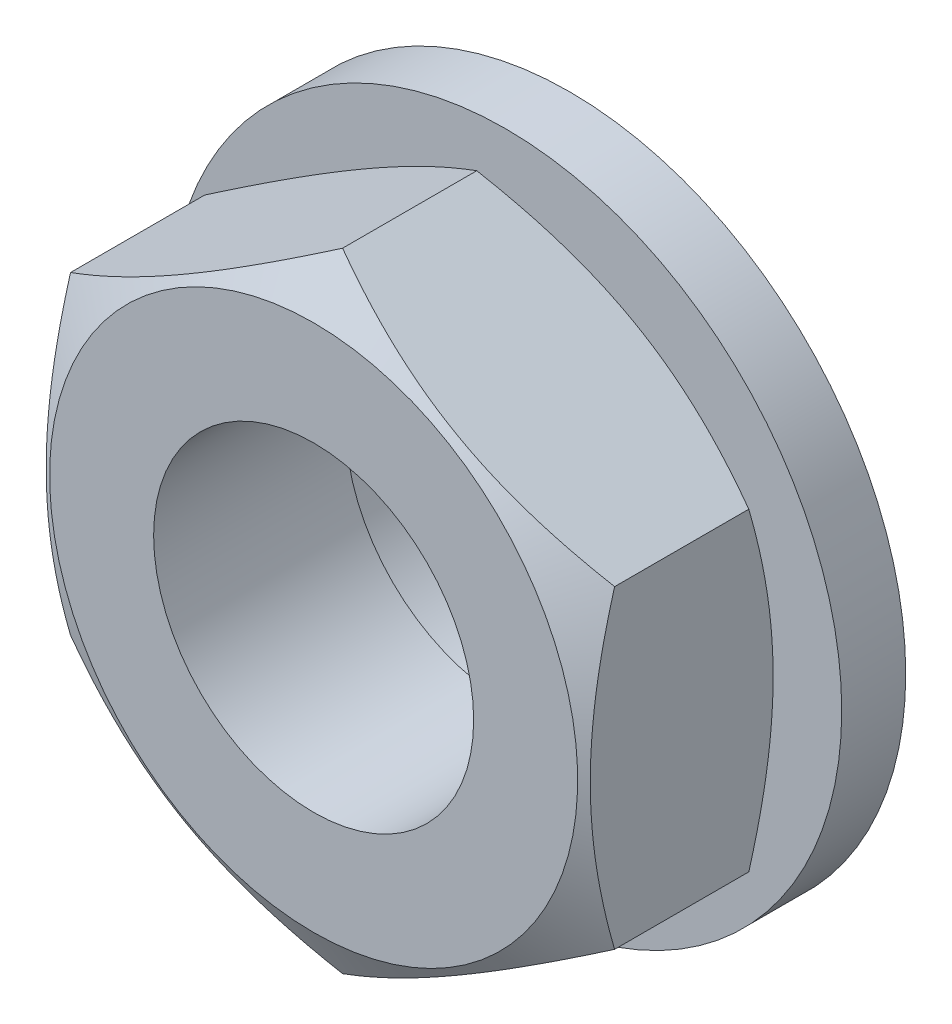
ISO-10303-21;
HEADER;
FILE_DESCRIPTION(('STEP AP214'),'2;1');
FILE_NAME('part.step','',(''),(''),'','','');
FILE_SCHEMA(('AUTOMOTIVE_DESIGN { 1 0 10303 214 1 1 1 1 }'));
ENDSEC;
DATA;
#1=APPLICATION_CONTEXT('core data for automotive mechanical design processes');
#2=APPLICATION_PROTOCOL_DEFINITION('international standard','automotive_design',2000,#1);
#3=PRODUCT_CONTEXT('',#1,'mechanical');
#4=PRODUCT('Part','Part','',(#3));
#5=PRODUCT_RELATED_PRODUCT_CATEGORY('part','',(#4));
#6=PRODUCT_DEFINITION_FORMATION('','',#4);
#7=PRODUCT_DEFINITION_CONTEXT('part definition',#1,'design');
#8=PRODUCT_DEFINITION('design','',#6,#7);
#9=PRODUCT_DEFINITION_SHAPE('','',#8);
#10=(LENGTH_UNIT() NAMED_UNIT(*) SI_UNIT(.MILLI.,.METRE.));
#11=(NAMED_UNIT(*) PLANE_ANGLE_UNIT() SI_UNIT($,.RADIAN.));
#12=(NAMED_UNIT(*) SI_UNIT($,.STERADIAN.) SOLID_ANGLE_UNIT());
#13=UNCERTAINTY_MEASURE_WITH_UNIT(LENGTH_MEASURE(1.E-05),#10,'distance_accuracy_value','');
#14=(GEOMETRIC_REPRESENTATION_CONTEXT(3) GLOBAL_UNCERTAINTY_ASSIGNED_CONTEXT((#13)) GLOBAL_UNIT_ASSIGNED_CONTEXT((#10,
#11,#12)) REPRESENTATION_CONTEXT('',''));
#15=CARTESIAN_POINT('',(0.,0.,0.));
#16=DIRECTION('',(0.,0.,1.));
#17=DIRECTION('',(1.,0.,0.));
#18=AXIS2_PLACEMENT_3D('',#15,#16,#17);
#19=CARTESIAN_POINT('',(-8.5,-4.90747728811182,10.));
#20=DIRECTION('',(-1.,0.,0.));
#21=DIRECTION('',(0.,0.,1.));
#22=AXIS2_PLACEMENT_3D('',#19,#20,#21);
#23=PLANE('',#22);
#24=CARTESIAN_POINT('',(-8.5,-13.2220103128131,3.68805373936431));
#25=CARTESIAN_POINT('',(-8.5,-12.8504235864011,3.86846678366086));
#26=CARTESIAN_POINT('',(-8.5,-12.4779881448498,4.04716148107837));
#27=CARTESIAN_POINT('',(-8.5,-11.7309686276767,4.40014855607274));
#28=CARTESIAN_POINT('',(-8.5,-11.356384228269,4.57444024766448));
#29=CARTESIAN_POINT('',(-8.5,-10.602704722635,4.91852400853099));
#30=CARTESIAN_POINT('',(-8.5,-10.2235961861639,5.08828676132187));
#31=CARTESIAN_POINT('',(-8.5,-9.46237784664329,5.42091824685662));
#32=CARTESIAN_POINT('',(-8.5,-9.08026818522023,5.5837873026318));
#33=CARTESIAN_POINT('',(-8.5,-8.29995060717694,5.90596922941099));
#34=CARTESIAN_POINT('',(-8.5,-7.90162321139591,6.06499431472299));
#35=CARTESIAN_POINT('',(-8.5,-7.10032398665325,6.37110535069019));
#36=CARTESIAN_POINT('',(-8.5,-6.69735164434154,6.51818996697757));
#37=CARTESIAN_POINT('',(-8.5,-5.88685796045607,6.79658764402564));
#38=CARTESIAN_POINT('',(-8.5,-5.47934758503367,6.927932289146));
#39=CARTESIAN_POINT('',(-8.5,-4.65849578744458,7.17066339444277));
#40=CARTESIAN_POINT('',(-8.5,-4.24515623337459,7.28205609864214));
#41=CARTESIAN_POINT('',(-8.5,-3.4146465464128,7.47896177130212));
#42=CARTESIAN_POINT('',(-8.5,-2.99751098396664,7.56461662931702));
#43=CARTESIAN_POINT('',(-8.5,-2.36797724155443,7.67010811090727));
#44=CARTESIAN_POINT('',(-8.5,-2.15747910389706,7.70144155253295));
#45=CARTESIAN_POINT('',(-8.5,-1.7354230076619,7.75583120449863));
#46=CARTESIAN_POINT('',(-8.5,-1.52386515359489,7.77888821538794));
#47=CARTESIAN_POINT('',(-8.5,-1.10275446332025,7.81597435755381));
#48=CARTESIAN_POINT('',(-8.5,-0.893211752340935,7.83011800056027));
#49=CARTESIAN_POINT('',(-8.5,-0.473715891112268,7.84952934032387));
#50=CARTESIAN_POINT('',(-8.5,-0.263762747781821,7.85479718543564));
#51=CARTESIAN_POINT('',(-8.5,0.156178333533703,7.85633113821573));
#52=CARTESIAN_POINT('',(-8.5,0.366166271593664,7.85259722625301));
#53=CARTESIAN_POINT('',(-8.5,0.785797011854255,7.83621947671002));
#54=CARTESIAN_POINT('',(-8.5,0.995439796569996,7.82357520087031));
#55=CARTESIAN_POINT('',(-8.5,1.49806512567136,7.78284710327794));
#56=CARTESIAN_POINT('',(-8.5,1.79071777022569,7.75060284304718));
#57=CARTESIAN_POINT('',(-8.5,2.37386344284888,7.6705007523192));
#58=CARTESIAN_POINT('',(-8.5,2.66435617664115,7.62264083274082));
#59=CARTESIAN_POINT('',(-8.5,3.53225535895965,7.45817427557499));
#60=CARTESIAN_POINT('',(-8.5,4.10576233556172,7.32071025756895));
#61=CARTESIAN_POINT('',(-8.5,4.96336295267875,7.08216925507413));
#62=CARTESIAN_POINT('',(-8.5,5.25190046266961,6.9961484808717));
#63=CARTESIAN_POINT('',(-8.5,5.82617341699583,6.81513030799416));
#64=CARTESIAN_POINT('',(-8.5,6.11190884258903,6.72013284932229));
#65=CARTESIAN_POINT('',(-8.5,6.68066668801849,6.52268903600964));
#66=CARTESIAN_POINT('',(-8.5,6.96368995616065,6.42024510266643));
#67=CARTESIAN_POINT('',(-8.5,7.52738867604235,6.2091179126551));
#68=CARTESIAN_POINT('',(-8.5,7.80806415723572,6.10043473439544));
#69=CARTESIAN_POINT('',(-8.5,8.47808910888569,5.83378477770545));
#70=CARTESIAN_POINT('',(-8.5,8.86645338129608,5.67334679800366));
#71=CARTESIAN_POINT('',(-8.5,9.6398127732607,5.34452258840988));
#72=CARTESIAN_POINT('',(-8.5,10.0248076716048,5.17613584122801));
#73=CARTESIAN_POINT('',(-8.5,10.7920682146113,4.83303130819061));
#74=CARTESIAN_POINT('',(-8.5,11.174333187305,4.65831202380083));
#75=CARTESIAN_POINT('',(-8.5,11.9365059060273,4.30384068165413));
#76=CARTESIAN_POINT('',(-8.5,12.3164137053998,4.12408873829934));
#77=CARTESIAN_POINT('',(-8.5,13.0747039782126,3.76030061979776));
#78=CARTESIAN_POINT('',(-8.5,13.4530842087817,3.57625977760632));
#79=CARTESIAN_POINT('',(-8.5,14.2081968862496,3.20482942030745));
#80=CARTESIAN_POINT('',(-8.5,14.5849293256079,3.01743988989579));
#81=CARTESIAN_POINT('',(-8.5,15.7129519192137,2.45120240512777));
#82=CARTESIAN_POINT('',(-8.5,16.4621734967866,2.06823420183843));
#83=CARTESIAN_POINT('',(-8.5,17.8924783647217,1.32781566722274));
#84=CARTESIAN_POINT('',(-8.5,18.5738900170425,0.970996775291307));
#85=CARTESIAN_POINT('',(-8.5,19.9341904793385,0.252523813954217));
#86=CARTESIAN_POINT('',(-8.5,20.6130791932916,-0.109130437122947));
#87=CARTESIAN_POINT('',(-8.5,21.9671358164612,-0.835169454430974));
#88=CARTESIAN_POINT('',(-8.5,22.6423088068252,-1.19954475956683));
#89=CARTESIAN_POINT('',(-8.5,23.9910464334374,-1.93116924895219));
#90=CARTESIAN_POINT('',(-8.5,24.6646111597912,-2.29841826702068));
#91=CARTESIAN_POINT('',(-8.5,25.3375864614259,-2.66673700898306));
#92=B_SPLINE_CURVE_WITH_KNOTS('',3,(#24,#25,#26,#27,#28,#29,#30,#31,#32,#33,#34,#35,#36,#37,#38,
#39,#40,#41,#42,#43,#44,#45,#46,#47,#48,#49,#50,#51,#52,#53,#54,#55,#56,#57,#58,#59,#60,#61,#62,
#63,#64,#65,#66,#67,#68,#69,#70,#71,#72,#73,#74,#75,#76,#77,#78,#79,#80,#81,#82,#83,#84,#85,#86,
#87,#88,#89,#90,#91),.UNSPECIFIED.,.F.,.F.,(4,2,2,2,2,2,2,2,2,2,2,2,2,2,2,2,2,2,2,2,2,2,2,2,2,2,
2,2,2,2,2,2,2,4),(0.,1.23922034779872,2.47863258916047,3.72472525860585,4.97075947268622,
6.25730558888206,7.54399528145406,8.82805821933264,10.1117186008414,11.3881667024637,
12.0264818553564,12.6647352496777,13.2946121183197,13.9244784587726,14.5543461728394,
15.1842448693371,16.0670176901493,16.9499086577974,18.7166516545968,19.6198369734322,
20.5230283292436,21.425927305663,22.3288149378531,23.589291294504,24.8498497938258,
26.1107085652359,27.3715386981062,28.6338115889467,29.8960902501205,32.4202938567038,
34.7278204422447,37.0354339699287,39.3370893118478,41.6386125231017),.UNSPECIFIED.);
#93=CARTESIAN_POINT('',(-8.5,4.90747728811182,7.09647305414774));
#94=VERTEX_POINT('',#93);
#95=CARTESIAN_POINT('',(-8.5,-4.90747728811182,7.09647305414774));
#96=VERTEX_POINT('',#95);
#97=EDGE_CURVE('E69',#94,#96,#92,.F.);
#98=ORIENTED_EDGE('',*,*,#97,.F.);
#99=DIRECTION('',(0.,0.,-1.));
#100=VECTOR('',#99,1.);
#101=CARTESIAN_POINT('',(-8.5,4.90747728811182,10.));
#102=LINE('',#101,#100);
#103=CARTESIAN_POINT('',(-8.5,4.90747728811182,2.90352694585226));
#104=VERTEX_POINT('',#103);
#105=EDGE_CURVE('E38',#94,#104,#102,.T.);
#106=ORIENTED_EDGE('',*,*,#105,.T.);
#107=CARTESIAN_POINT('',(-8.5,-13.217348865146,6.30968253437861));
#108=CARTESIAN_POINT('',(-8.5,-12.8458016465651,6.1293073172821));
#109=CARTESIAN_POINT('',(-8.5,-12.4734053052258,5.95065142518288));
#110=CARTESIAN_POINT('',(-8.5,-11.7264629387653,5.59774455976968));
#111=CARTESIAN_POINT('',(-8.5,-11.3519165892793,5.42349427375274));
#112=CARTESIAN_POINT('',(-8.5,-10.598309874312,5.07949578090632));
#113=CARTESIAN_POINT('',(-8.5,-10.2192360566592,4.90977694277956));
#114=CARTESIAN_POINT('',(-8.5,-9.45808580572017,4.57723767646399));
#115=CARTESIAN_POINT('',(-8.5,-9.07600951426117,4.41441692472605));
#116=CARTESIAN_POINT('',(-8.5,-8.29577621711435,4.09234631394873));
#117=CARTESIAN_POINT('',(-8.5,-7.89749985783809,3.93338400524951));
#118=CARTESIAN_POINT('',(-8.5,-7.09630157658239,3.62740499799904));
#119=CARTESIAN_POINT('',(-8.5,-6.69337914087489,3.48038963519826));
#120=CARTESIAN_POINT('',(-8.5,-5.88298561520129,3.20213853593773));
#121=CARTESIAN_POINT('',(-8.5,-5.47552550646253,3.07087115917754));
#122=CARTESIAN_POINT('',(-8.5,-4.65477495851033,2.82830325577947));
#123=CARTESIAN_POINT('',(-8.5,-4.24148638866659,2.71699647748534));
#124=CARTESIAN_POINT('',(-8.5,-3.4110781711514,2.52026959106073));
#125=CARTESIAN_POINT('',(-8.5,-2.99399303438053,2.43470772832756));
#126=CARTESIAN_POINT('',(-8.5,-2.36453907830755,2.32935942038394));
#127=CARTESIAN_POINT('',(-8.5,-2.15406819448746,2.2980743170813));
#128=CARTESIAN_POINT('',(-8.5,-1.7320683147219,2.24378173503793));
#129=CARTESIAN_POINT('',(-8.5,-1.52053942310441,2.22077345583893));
#130=CARTESIAN_POINT('',(-8.5,-1.09948590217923,2.18378334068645));
#131=CARTESIAN_POINT('',(-8.5,-0.889971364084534,2.16968709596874));
#132=CARTESIAN_POINT('',(-8.5,-0.47053384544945,2.15036906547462));
#133=CARTESIAN_POINT('',(-8.5,-0.26061087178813,2.14514713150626));
#134=CARTESIAN_POINT('',(-8.5,0.159267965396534,2.14370240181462));
#135=CARTESIAN_POINT('',(-8.5,0.369223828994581,2.1474796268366));
#136=CARTESIAN_POINT('',(-8.5,0.788788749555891,2.16394041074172));
#137=CARTESIAN_POINT('',(-8.5,0.998397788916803,2.17662440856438));
#138=CARTESIAN_POINT('',(-8.5,1.50108256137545,2.21745420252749));
#139=CARTESIAN_POINT('',(-8.5,1.793827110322,2.24976654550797));
#140=CARTESIAN_POINT('',(-8.5,2.37715285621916,2.33000952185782));
#141=CARTESIAN_POINT('',(-8.5,2.66773375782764,2.37794224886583));
#142=CARTESIAN_POINT('',(-8.5,3.53589346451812,2.54263019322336));
#143=CARTESIAN_POINT('',(-8.5,4.10956801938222,2.68024561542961));
#144=CARTESIAN_POINT('',(-8.5,4.96741250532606,2.91901019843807));
#145=CARTESIAN_POINT('',(-8.5,5.25602859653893,3.00510487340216));
#146=CARTESIAN_POINT('',(-8.5,5.83045786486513,3.18626877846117));
#147=CARTESIAN_POINT('',(-8.5,6.11627102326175,3.28133806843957));
#148=CARTESIAN_POINT('',(-8.5,6.68518369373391,3.47892313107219));
#149=CARTESIAN_POINT('',(-8.5,6.96828405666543,3.58143647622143));
#150=CARTESIAN_POINT('',(-8.5,7.53213698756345,3.79270023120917));
#151=CARTESIAN_POINT('',(-8.5,7.81288958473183,3.90145056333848));
#152=CARTESIAN_POINT('',(-8.5,8.48212780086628,4.1678721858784));
#153=CARTESIAN_POINT('',(-8.5,8.86963833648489,4.32798850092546));
#154=CARTESIAN_POINT('',(-8.5,9.64130597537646,4.65613130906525));
#155=CARTESIAN_POINT('',(-8.5,10.0254628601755,4.82415831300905));
#156=CARTESIAN_POINT('',(-8.5,10.7910586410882,5.16651606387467));
#157=CARTESIAN_POINT('',(-8.5,11.172496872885,5.34084829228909));
#158=CARTESIAN_POINT('',(-8.5,11.9330253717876,5.69452635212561));
#159=CARTESIAN_POINT('',(-8.5,12.3121156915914,5.87387207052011));
#160=CARTESIAN_POINT('',(-8.5,13.0687747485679,6.23683235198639));
#161=CARTESIAN_POINT('',(-8.5,13.4463412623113,6.42045154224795));
#162=CARTESIAN_POINT('',(-8.5,14.1998317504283,6.7910284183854));
#163=CARTESIAN_POINT('',(-8.5,14.5757557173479,6.9779861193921));
#164=CARTESIAN_POINT('',(-8.5,15.7013597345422,7.54291756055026));
#165=CARTESIAN_POINT('',(-8.5,16.448977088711,7.92500052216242));
#166=CARTESIAN_POINT('',(-8.5,17.8763952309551,8.6637998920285));
#167=CARTESIAN_POINT('',(-8.5,18.5565227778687,9.01988783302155));
#168=CARTESIAN_POINT('',(-8.5,19.9142584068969,9.73689269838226));
#169=CARTESIAN_POINT('',(-8.5,20.5918663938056,10.0978098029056));
#170=CARTESIAN_POINT('',(-8.5,21.9433746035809,10.8223769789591));
#171=CARTESIAN_POINT('',(-8.5,22.6172798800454,11.186017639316));
#172=CARTESIAN_POINT('',(-8.5,23.963483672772,11.9161708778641));
#173=CARTESIAN_POINT('',(-8.5,24.6357822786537,12.2826832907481));
#174=CARTESIAN_POINT('',(-8.5,25.3074917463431,12.6502650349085));
#175=B_SPLINE_CURVE_WITH_KNOTS('',3,(#107,#108,#109,#110,#111,#112,#113,#114,#115,#116,#117,
#118,#119,#120,#121,#122,#123,#124,#125,#126,#127,#128,#129,#130,#131,#132,#133,#134,#135,#136,
#137,#138,#139,#140,#141,#142,#143,#144,#145,#146,#147,#148,#149,#150,#151,#152,#153,#154,#155,
#156,#157,#158,#159,#160,#161,#162,#163,#164,#165,#166,#167,#168,#169,#170,#171,#172,#173,#174),
.UNSPECIFIED.,.F.,.F.,(4,2,2,2,2,2,2,2,2,2,2,2,2,2,2,2,2,2,2,2,2,2,2,2,2,2,2,2,2,2,2,2,2,4),(0.,
1.23906418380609,2.47832048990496,3.7242641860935,4.97014937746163,6.25648329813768,
7.54296084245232,8.82680874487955,10.1102538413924,11.3864970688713,12.0247099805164,
12.6628611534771,13.2926441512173,13.9224166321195,14.5521905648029,15.1819955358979,
16.0650645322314,16.9482519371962,18.7155902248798,19.6190649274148,20.5225456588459,
21.4257330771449,22.3289092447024,23.5866510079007,24.8444741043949,26.1025946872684,
27.3606869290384,28.6202113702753,29.8797415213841,32.3984513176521,34.7015479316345,
37.0047307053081,39.3019924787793,41.599122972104),.UNSPECIFIED.);
#176=CARTESIAN_POINT('',(-8.5,-4.90747728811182,2.90352694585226));
#177=VERTEX_POINT('',#176);
#178=EDGE_CURVE('E88',#177,#104,#175,.T.);
#179=ORIENTED_EDGE('',*,*,#178,.F.);
#180=DIRECTION('',(0.,0.,-1.));
#181=VECTOR('',#180,1.);
#182=CARTESIAN_POINT('',(-8.5,-4.90747728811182,10.));
#183=LINE('',#182,#181);
#184=EDGE_CURVE('E73',#96,#177,#183,.T.);
#185=ORIENTED_EDGE('',*,*,#184,.F.);
#186=EDGE_LOOP('',(#98,#106,#179,#185));
#187=FACE_BOUND('',#186,.T.);
#188=ADVANCED_FACE('F14',(#187),#23,.T.);
#189=CARTESIAN_POINT('',(-8.5,-4.90747728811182,10.));
#190=DIRECTION('',(0.5,0.866025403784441,0.));
#191=DIRECTION('',(-0.866025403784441,0.5,0.));
#192=AXIS2_PLACEMENT_3D('',#189,#190,#191);
#193=PLANE('',#192);
#194=DIRECTION('',(0.,0.,-1.));
#195=VECTOR('',#194,1.);
#196=CARTESIAN_POINT('',(0.,-9.81495457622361,10.));
#197=LINE('',#196,#195);
#198=CARTESIAN_POINT('',(0.,-9.81495457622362,7.09647305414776));
#199=VERTEX_POINT('',#198);
#200=CARTESIAN_POINT('',(0.,-9.81495457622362,2.90352694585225));
#201=VERTEX_POINT('',#200);
#202=EDGE_CURVE('E95',#199,#201,#197,.T.);
#203=ORIENTED_EDGE('',*,*,#202,.F.);
#204=CARTESIAN_POINT('',(0.000200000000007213,-9.81507004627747,7.09640638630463));
#205=CARTESIAN_POINT('',(-0.186639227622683,-9.70719836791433,7.15867629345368));
#206=CARTESIAN_POINT('',(-0.37417505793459,-9.59892450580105,7.21812013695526));
#207=CARTESIAN_POINT('',(-0.750769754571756,-9.38149745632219,7.33057732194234));
#208=CARTESIAN_POINT('',(-0.939829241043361,-9.27234391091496,7.38358788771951));
#209=CARTESIAN_POINT('',(-1.51003475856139,-8.94313560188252,7.53192904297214));
#210=CARTESIAN_POINT('',(-1.89343164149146,-8.72178130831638,7.61630350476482));
#211=CARTESIAN_POINT('',(-2.46717766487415,-8.39052888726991,7.71524241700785));
#212=CARTESIAN_POINT('',(-2.65581276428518,-8.28162036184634,7.7434272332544));
#213=CARTESIAN_POINT('',(-3.03393602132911,-8.06331079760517,7.7906883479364));
#214=CARTESIAN_POINT('',(-3.22342410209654,-7.95390980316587,7.80976545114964));
#215=CARTESIAN_POINT('',(-3.6027265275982,-7.73491944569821,7.8383276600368));
#216=CARTESIAN_POINT('',(-3.79254025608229,-7.62533043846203,7.84782365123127));
#217=CARTESIAN_POINT('',(-4.17234305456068,-7.40605119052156,7.85702005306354));
#218=CARTESIAN_POINT('',(-4.36233211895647,-7.29636095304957,7.85672076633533));
#219=CARTESIAN_POINT('',(-4.71752301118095,-7.09129139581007,7.84700795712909));
#220=CARTESIAN_POINT('',(-4.8827499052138,-6.99589760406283,7.83877926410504));
#221=CARTESIAN_POINT('',(-5.21281671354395,-6.80533344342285,7.81507319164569));
#222=CARTESIAN_POINT('',(-5.37765660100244,-6.71016309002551,7.79959532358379));
#223=CARTESIAN_POINT('',(-5.87153810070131,-6.42502047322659,7.74265381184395));
#224=CARTESIAN_POINT('',(-6.19970550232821,-6.23555293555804,7.69068937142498));
#225=CARTESIAN_POINT('',(-6.85952142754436,-5.8546080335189,7.56077749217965));
#226=CARTESIAN_POINT('',(-7.19108574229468,-5.66317928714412,7.48227936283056));
#227=CARTESIAN_POINT('',(-7.84926989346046,-5.28317649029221,7.30412109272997));
#228=CARTESIAN_POINT('',(-8.17589815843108,-5.09459757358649,7.20450279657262));
#229=CARTESIAN_POINT('',(-8.5002,-4.90736181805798,7.09640638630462));
#230=B_SPLINE_CURVE_WITH_KNOTS('',3,(#204,#205,#206,#207,#208,#209,#210,#211,#212,#213,#214,
#215,#216,#217,#218,#219,#220,#221,#222,#223,#224,#225,#226,#227,#228,#229),.UNSPECIFIED.,.F.,
.F.,(4,2,2,2,2,2,2,2,2,2,2,2,4),(0.,0.673596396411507,1.34748239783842,2.69805431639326,
3.356799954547,4.01548737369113,4.67342558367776,5.33134346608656,5.9040955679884,
6.47688628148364,7.62328361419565,8.79510569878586,9.96462743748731),.UNSPECIFIED.);
#231=EDGE_CURVE('E76',#199,#96,#230,.T.);
#232=ORIENTED_EDGE('',*,*,#231,.T.);
#233=ORIENTED_EDGE('',*,*,#184,.T.);
#234=CARTESIAN_POINT('',(-8.5002,-4.90736181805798,2.90359361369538));
#235=CARTESIAN_POINT('',(-8.31336077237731,-5.01523349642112,2.84132370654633));
#236=CARTESIAN_POINT('',(-8.1258249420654,-5.1235073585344,2.78187986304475));
#237=CARTESIAN_POINT('',(-7.74923024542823,-5.34093440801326,2.66942267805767));
#238=CARTESIAN_POINT('',(-7.56017075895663,-5.45008795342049,2.6164121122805));
#239=CARTESIAN_POINT('',(-6.9899652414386,-5.77929626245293,2.46807095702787));
#240=CARTESIAN_POINT('',(-6.60656835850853,-6.00065055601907,2.38369649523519));
#241=CARTESIAN_POINT('',(-6.03282233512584,-6.33190297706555,2.28475758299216));
#242=CARTESIAN_POINT('',(-5.84418723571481,-6.44081150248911,2.2565727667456));
#243=CARTESIAN_POINT('',(-5.46606397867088,-6.65912106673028,2.20931165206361));
#244=CARTESIAN_POINT('',(-5.27657589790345,-6.76852206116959,2.19023454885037));
#245=CARTESIAN_POINT('',(-4.89727347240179,-6.98751241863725,2.16167233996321));
#246=CARTESIAN_POINT('',(-4.7074597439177,-7.09710142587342,2.15217634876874));
#247=CARTESIAN_POINT('',(-4.32765694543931,-7.3163806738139,2.14297994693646));
#248=CARTESIAN_POINT('',(-4.13766788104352,-7.42607091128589,2.14327923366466));
#249=CARTESIAN_POINT('',(-3.78247698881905,-7.63114046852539,2.15299204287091));
#250=CARTESIAN_POINT('',(-3.6172500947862,-7.72653426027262,2.16122073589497));
#251=CARTESIAN_POINT('',(-3.28718328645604,-7.9170984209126,2.18492680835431));
#252=CARTESIAN_POINT('',(-3.12234339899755,-8.01226877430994,2.20040467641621));
#253=CARTESIAN_POINT('',(-2.62846189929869,-8.29741139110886,2.25734618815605));
#254=CARTESIAN_POINT('',(-2.30029449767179,-8.48687892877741,2.30931062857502));
#255=CARTESIAN_POINT('',(-1.64047857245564,-8.86782383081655,2.43922250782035));
#256=CARTESIAN_POINT('',(-1.30891425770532,-9.05925257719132,2.51772063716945));
#257=CARTESIAN_POINT('',(-0.650730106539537,-9.43925537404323,2.69587890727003));
#258=CARTESIAN_POINT('',(-0.324101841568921,-9.62783429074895,2.79549720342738));
#259=CARTESIAN_POINT('',(0.000199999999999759,-9.81507004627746,2.90359361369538));
#260=B_SPLINE_CURVE_WITH_KNOTS('',3,(#234,#235,#236,#237,#238,#239,#240,#241,#242,#243,#244,
#245,#246,#247,#248,#249,#250,#251,#252,#253,#254,#255,#256,#257,#258,#259),.UNSPECIFIED.,.F.,
.F.,(4,2,2,2,2,2,2,2,2,2,2,2,4),(0.,0.673596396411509,1.34748239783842,2.69805431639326,
3.356799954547,4.01548737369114,4.67342558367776,5.33134346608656,5.9040955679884,
6.47688628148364,7.62328361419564,8.79510569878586,9.96462743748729),.UNSPECIFIED.);
#261=EDGE_CURVE('E165',#177,#201,#260,.T.);
#262=ORIENTED_EDGE('',*,*,#261,.T.);
#263=EDGE_LOOP('',(#203,#232,#233,#262));
#264=FACE_BOUND('',#263,.T.);
#265=ADVANCED_FACE('F16',(#264),#193,.F.);
#266=CARTESIAN_POINT('',(8.5,-4.90747728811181,10.));
#267=DIRECTION('',(0.5,-0.86602540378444,0.));
#268=DIRECTION('',(0.86602540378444,0.5,0.));
#269=AXIS2_PLACEMENT_3D('',#266,#267,#268);
#270=PLANE('',#269);
#271=CARTESIAN_POINT('',(-0.000199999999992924,-9.81507004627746,7.09640638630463));
#272=CARTESIAN_POINT('',(0.186639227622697,-9.70719836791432,7.15867629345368));
#273=CARTESIAN_POINT('',(0.374175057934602,-9.59892450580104,7.21812013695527));
#274=CARTESIAN_POINT('',(0.750769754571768,-9.38149745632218,7.33057732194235));
#275=CARTESIAN_POINT('',(0.939829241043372,-9.27234391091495,7.38358788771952));
#276=CARTESIAN_POINT('',(1.5100347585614,-8.9431356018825,7.53192904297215));
#277=CARTESIAN_POINT('',(1.89343164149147,-8.72178130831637,7.61630350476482));
#278=CARTESIAN_POINT('',(2.46717766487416,-8.39052888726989,7.71524241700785));
#279=CARTESIAN_POINT('',(2.65581276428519,-8.28162036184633,7.74342723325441));
#280=CARTESIAN_POINT('',(3.03393602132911,-8.06331079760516,7.7906883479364));
#281=CARTESIAN_POINT('',(3.22342410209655,-7.95390980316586,7.80976545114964));
#282=CARTESIAN_POINT('',(3.60272652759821,-7.7349194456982,7.8383276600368));
#283=CARTESIAN_POINT('',(3.7925402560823,-7.62533043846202,7.84782365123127));
#284=CARTESIAN_POINT('',(4.17234305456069,-7.40605119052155,7.85702005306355));
#285=CARTESIAN_POINT('',(4.36233211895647,-7.29636095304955,7.85672076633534));
#286=CARTESIAN_POINT('',(4.71752301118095,-7.09129139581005,7.8470079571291));
#287=CARTESIAN_POINT('',(4.8827499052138,-6.99589760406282,7.83877926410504));
#288=CARTESIAN_POINT('',(5.21281671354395,-6.80533344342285,7.81507319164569));
#289=CARTESIAN_POINT('',(5.37765660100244,-6.7101630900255,7.7995953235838));
#290=CARTESIAN_POINT('',(5.87153810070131,-6.42502047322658,7.74265381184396));
#291=CARTESIAN_POINT('',(6.19970550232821,-6.23555293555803,7.69068937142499));
#292=CARTESIAN_POINT('',(6.85952142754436,-5.85460803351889,7.56077749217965));
#293=CARTESIAN_POINT('',(7.19108574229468,-5.66317928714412,7.48227936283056));
#294=CARTESIAN_POINT('',(7.84926989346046,-5.2831764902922,7.30412109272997));
#295=CARTESIAN_POINT('',(8.17589815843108,-5.09459757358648,7.20450279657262));
#296=CARTESIAN_POINT('',(8.5002,-4.90736181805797,7.09640638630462));
#297=B_SPLINE_CURVE_WITH_KNOTS('',3,(#271,#272,#273,#274,#275,#276,#277,#278,#279,#280,#281,
#282,#283,#284,#285,#286,#287,#288,#289,#290,#291,#292,#293,#294,#295,#296),.UNSPECIFIED.,.F.,
.F.,(4,2,2,2,2,2,2,2,2,2,2,2,4),(0.,0.673596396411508,1.34748239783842,2.69805431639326,
3.356799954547,4.01548737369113,4.67342558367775,5.33134346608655,5.90409556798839,
6.47688628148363,7.62328361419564,8.79510569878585,9.96462743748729),.UNSPECIFIED.);
#298=CARTESIAN_POINT('',(8.5,-4.90747728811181,7.09647305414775));
#299=VERTEX_POINT('',#298);
#300=EDGE_CURVE('E138',#199,#299,#297,.T.);
#301=ORIENTED_EDGE('',*,*,#300,.F.);
#302=ORIENTED_EDGE('',*,*,#202,.T.);
#303=CARTESIAN_POINT('',(8.5002,-4.90736181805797,2.90359361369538));
#304=CARTESIAN_POINT('',(8.31336077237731,-5.01523349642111,2.84132370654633));
#305=CARTESIAN_POINT('',(8.1258249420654,-5.12350735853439,2.78187986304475));
#306=CARTESIAN_POINT('',(7.74923024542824,-5.34093440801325,2.66942267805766));
#307=CARTESIAN_POINT('',(7.56017075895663,-5.45008795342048,2.61641211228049));
#308=CARTESIAN_POINT('',(6.9899652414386,-5.77929626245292,2.46807095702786));
#309=CARTESIAN_POINT('',(6.60656835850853,-6.00065055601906,2.38369649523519));
#310=CARTESIAN_POINT('',(6.03282233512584,-6.33190297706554,2.28475758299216));
#311=CARTESIAN_POINT('',(5.84418723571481,-6.4408115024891,2.2565727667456));
#312=CARTESIAN_POINT('',(5.46606397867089,-6.65912106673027,2.2093116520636));
#313=CARTESIAN_POINT('',(5.27657589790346,-6.76852206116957,2.19023454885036));
#314=CARTESIAN_POINT('',(4.8972734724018,-6.98751241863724,2.16167233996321));
#315=CARTESIAN_POINT('',(4.7074597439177,-7.09710142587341,2.15217634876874));
#316=CARTESIAN_POINT('',(4.32765694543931,-7.31638067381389,2.14297994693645));
#317=CARTESIAN_POINT('',(4.13766788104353,-7.42607091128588,2.14327923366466));
#318=CARTESIAN_POINT('',(3.78247698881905,-7.63114046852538,2.1529920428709));
#319=CARTESIAN_POINT('',(3.6172500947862,-7.72653426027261,2.16122073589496));
#320=CARTESIAN_POINT('',(3.28718328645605,-7.91709842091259,2.18492680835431));
#321=CARTESIAN_POINT('',(3.12234339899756,-8.01226877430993,2.20040467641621));
#322=CARTESIAN_POINT('',(2.62846189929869,-8.29741139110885,2.25734618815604));
#323=CARTESIAN_POINT('',(2.30029449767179,-8.4868789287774,2.30931062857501));
#324=CARTESIAN_POINT('',(1.64047857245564,-8.86782383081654,2.43922250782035));
#325=CARTESIAN_POINT('',(1.30891425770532,-9.05925257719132,2.51772063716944));
#326=CARTESIAN_POINT('',(0.650730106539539,-9.43925537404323,2.69587890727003));
#327=CARTESIAN_POINT('',(0.324101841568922,-9.62783429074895,2.79549720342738));
#328=CARTESIAN_POINT('',(-0.000199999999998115,-9.81507004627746,2.90359361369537));
#329=B_SPLINE_CURVE_WITH_KNOTS('',3,(#303,#304,#305,#306,#307,#308,#309,#310,#311,#312,#313,
#314,#315,#316,#317,#318,#319,#320,#321,#322,#323,#324,#325,#326,#327,#328),.UNSPECIFIED.,.F.,
.F.,(4,2,2,2,2,2,2,2,2,2,2,2,4),(0.,0.673596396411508,1.34748239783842,2.69805431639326,
3.356799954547,4.01548737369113,4.67342558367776,5.33134346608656,5.9040955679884,
6.47688628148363,7.62328361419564,8.79510569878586,9.9646274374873),.UNSPECIFIED.);
#330=CARTESIAN_POINT('',(8.5,-4.90747728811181,2.90352694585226));
#331=VERTEX_POINT('',#330);
#332=EDGE_CURVE('E197',#331,#201,#329,.T.);
#333=ORIENTED_EDGE('',*,*,#332,.F.);
#334=DIRECTION('',(0.,0.,-1.));
#335=VECTOR('',#334,1.);
#336=CARTESIAN_POINT('',(8.5,-4.90747728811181,10.));
#337=LINE('',#336,#335);
#338=EDGE_CURVE('E93',#299,#331,#337,.T.);
#339=ORIENTED_EDGE('',*,*,#338,.F.);
#340=EDGE_LOOP('',(#301,#302,#333,#339));
#341=FACE_BOUND('',#340,.T.);
#342=ADVANCED_FACE('F203',(#341),#270,.T.);
#343=CARTESIAN_POINT('',(8.5,-4.90747728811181,10.));
#344=DIRECTION('',(-1.,0.,0.));
#345=DIRECTION('',(0.,0.,1.));
#346=AXIS2_PLACEMENT_3D('',#343,#344,#345);
#347=PLANE('',#346);
#348=DIRECTION('',(0.,0.,-1.));
#349=VECTOR('',#348,1.);
#350=CARTESIAN_POINT('',(8.5,4.90747728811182,10.));
#351=LINE('',#350,#349);
#352=CARTESIAN_POINT('',(8.5,4.90747728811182,7.09647305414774));
#353=VERTEX_POINT('',#352);
#354=CARTESIAN_POINT('',(8.5,4.90747728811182,2.90352694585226));
#355=VERTEX_POINT('',#354);
#356=EDGE_CURVE('E85',#353,#355,#351,.T.);
#357=ORIENTED_EDGE('',*,*,#356,.F.);
#358=CARTESIAN_POINT('',(8.5,-13.2220103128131,3.68805373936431));
#359=CARTESIAN_POINT('',(8.5,-12.8504235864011,3.86846678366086));
#360=CARTESIAN_POINT('',(8.5,-12.4779881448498,4.04716148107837));
#361=CARTESIAN_POINT('',(8.5,-11.7309686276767,4.40014855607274));
#362=CARTESIAN_POINT('',(8.5,-11.356384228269,4.57444024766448));
#363=CARTESIAN_POINT('',(8.5,-10.602704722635,4.91852400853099));
#364=CARTESIAN_POINT('',(8.5,-10.2235961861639,5.08828676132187));
#365=CARTESIAN_POINT('',(8.5,-9.46237784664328,5.42091824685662));
#366=CARTESIAN_POINT('',(8.5,-9.08026818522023,5.5837873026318));
#367=CARTESIAN_POINT('',(8.5,-8.29995060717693,5.90596922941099));
#368=CARTESIAN_POINT('',(8.5,-7.9016232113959,6.064994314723));
#369=CARTESIAN_POINT('',(8.5,-7.10032398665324,6.37110535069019));
#370=CARTESIAN_POINT('',(8.5,-6.69735164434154,6.51818996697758));
#371=CARTESIAN_POINT('',(8.5,-5.88685796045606,6.79658764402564));
#372=CARTESIAN_POINT('',(8.5,-5.47934758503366,6.927932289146));
#373=CARTESIAN_POINT('',(8.5,-4.65849578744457,7.17066339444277));
#374=CARTESIAN_POINT('',(8.5,-4.24515623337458,7.28205609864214));
#375=CARTESIAN_POINT('',(8.5,-3.41464654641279,7.47896177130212));
#376=CARTESIAN_POINT('',(8.5,-2.99751098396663,7.56461662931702));
#377=CARTESIAN_POINT('',(8.5,-2.36797724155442,7.67010811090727));
#378=CARTESIAN_POINT('',(8.5,-2.15747910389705,7.70144155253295));
#379=CARTESIAN_POINT('',(8.5,-1.73542300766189,7.75583120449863));
#380=CARTESIAN_POINT('',(8.5,-1.52386515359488,7.77888821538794));
#381=CARTESIAN_POINT('',(8.5,-1.10275446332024,7.81597435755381));
#382=CARTESIAN_POINT('',(8.5,-0.893211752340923,7.83011800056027));
#383=CARTESIAN_POINT('',(8.5,-0.473715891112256,7.84952934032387));
#384=CARTESIAN_POINT('',(8.5,-0.26376274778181,7.85479718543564));
#385=CARTESIAN_POINT('',(8.5,0.156178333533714,7.85633113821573));
#386=CARTESIAN_POINT('',(8.5,0.366166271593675,7.85259722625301));
#387=CARTESIAN_POINT('',(8.5,0.785797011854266,7.83621947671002));
#388=CARTESIAN_POINT('',(8.5,0.995439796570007,7.82357520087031));
#389=CARTESIAN_POINT('',(8.5,1.49806512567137,7.78284710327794));
#390=CARTESIAN_POINT('',(8.5,1.7907177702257,7.75060284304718));
#391=CARTESIAN_POINT('',(8.5,2.37386344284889,7.6705007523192));
#392=CARTESIAN_POINT('',(8.5,2.66435617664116,7.62264083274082));
#393=CARTESIAN_POINT('',(8.5,3.53225535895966,7.45817427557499));
#394=CARTESIAN_POINT('',(8.5,4.10576233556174,7.32071025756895));
#395=CARTESIAN_POINT('',(8.5,4.96336295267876,7.08216925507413));
#396=CARTESIAN_POINT('',(8.5,5.25190046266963,6.99614848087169));
#397=CARTESIAN_POINT('',(8.5,5.82617341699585,6.81513030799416));
#398=CARTESIAN_POINT('',(8.5,6.11190884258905,6.72013284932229));
#399=CARTESIAN_POINT('',(8.5,6.68066668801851,6.52268903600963));
#400=CARTESIAN_POINT('',(8.5,6.96368995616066,6.42024510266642));
#401=CARTESIAN_POINT('',(8.5,7.52738867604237,6.2091179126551));
#402=CARTESIAN_POINT('',(8.5,7.80806415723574,6.10043473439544));
#403=CARTESIAN_POINT('',(8.5,8.47808910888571,5.83378477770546));
#404=CARTESIAN_POINT('',(8.5,8.8664533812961,5.67334679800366));
#405=CARTESIAN_POINT('',(8.5,9.6398127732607,5.34452258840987));
#406=CARTESIAN_POINT('',(8.5,10.0248076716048,5.17613584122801));
#407=CARTESIAN_POINT('',(8.5,10.7920682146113,4.83303130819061));
#408=CARTESIAN_POINT('',(8.5,11.174333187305,4.65831202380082));
#409=CARTESIAN_POINT('',(8.5,11.9365059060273,4.30384068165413));
#410=CARTESIAN_POINT('',(8.5,12.3164137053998,4.12408873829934));
#411=CARTESIAN_POINT('',(8.5,13.0747039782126,3.76030061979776));
#412=CARTESIAN_POINT('',(8.5,13.4530842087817,3.57625977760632));
#413=CARTESIAN_POINT('',(8.5,14.2081968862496,3.20482942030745));
#414=CARTESIAN_POINT('',(8.5,14.5849293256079,3.01743988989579));
#415=CARTESIAN_POINT('',(8.5,15.7129519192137,2.45120240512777));
#416=CARTESIAN_POINT('',(8.5,16.4621734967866,2.06823420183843));
#417=CARTESIAN_POINT('',(8.5,17.8924783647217,1.32781566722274));
#418=CARTESIAN_POINT('',(8.5,18.5738900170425,0.970996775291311));
#419=CARTESIAN_POINT('',(8.5,19.9341904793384,0.252523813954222));
#420=CARTESIAN_POINT('',(8.5,20.6130791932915,-0.109130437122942));
#421=CARTESIAN_POINT('',(8.5,21.9671358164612,-0.835169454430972));
#422=CARTESIAN_POINT('',(8.5,22.6423088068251,-1.19954475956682));
#423=CARTESIAN_POINT('',(8.5,23.9910464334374,-1.93116924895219));
#424=CARTESIAN_POINT('',(8.5,24.6646111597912,-2.29841826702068));
#425=CARTESIAN_POINT('',(8.5,25.3375864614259,-2.66673700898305));
#426=B_SPLINE_CURVE_WITH_KNOTS('',3,(#358,#359,#360,#361,#362,#363,#364,#365,#366,#367,#368,
#369,#370,#371,#372,#373,#374,#375,#376,#377,#378,#379,#380,#381,#382,#383,#384,#385,#386,#387,
#388,#389,#390,#391,#392,#393,#394,#395,#396,#397,#398,#399,#400,#401,#402,#403,#404,#405,#406,
#407,#408,#409,#410,#411,#412,#413,#414,#415,#416,#417,#418,#419,#420,#421,#422,#423,#424,#425),
.UNSPECIFIED.,.F.,.F.,(4,2,2,2,2,2,2,2,2,2,2,2,2,2,2,2,2,2,2,2,2,2,2,2,2,2,2,2,2,2,2,2,2,4),(0.,
1.23922034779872,2.47863258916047,3.72472525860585,4.97075947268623,6.25730558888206,
7.54399528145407,8.82805821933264,10.1117186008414,11.3881667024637,12.0264818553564,
12.6647352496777,13.2946121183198,13.9244784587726,14.5543461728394,15.1842448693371,
16.0670176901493,16.9499086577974,18.7166516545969,19.6198369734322,20.5230283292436,
21.4259273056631,22.3288149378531,23.589291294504,24.8498497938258,26.1107085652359,
27.3715386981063,28.6338115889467,29.8960902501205,32.4202938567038,34.7278204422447,
37.0354339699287,39.3370893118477,41.6386125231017),.UNSPECIFIED.);
#427=EDGE_CURVE('E131',#353,#299,#426,.F.);
#428=ORIENTED_EDGE('',*,*,#427,.T.);
#429=ORIENTED_EDGE('',*,*,#338,.T.);
#430=CARTESIAN_POINT('',(8.5,-13.217348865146,6.30968253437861));
#431=CARTESIAN_POINT('',(8.5,-12.8458016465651,6.1293073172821));
#432=CARTESIAN_POINT('',(8.5,-12.4734053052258,5.95065142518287));
#433=CARTESIAN_POINT('',(8.5,-11.7264629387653,5.59774455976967));
#434=CARTESIAN_POINT('',(8.5,-11.3519165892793,5.42349427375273));
#435=CARTESIAN_POINT('',(8.5,-10.5983098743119,5.07949578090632));
#436=CARTESIAN_POINT('',(8.5,-10.2192360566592,4.90977694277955));
#437=CARTESIAN_POINT('',(8.5,-9.45808580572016,4.57723767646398));
#438=CARTESIAN_POINT('',(8.5,-9.07600951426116,4.41441692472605));
#439=CARTESIAN_POINT('',(8.5,-8.29577621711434,4.09234631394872));
#440=CARTESIAN_POINT('',(8.5,-7.89749985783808,3.9333840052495));
#441=CARTESIAN_POINT('',(8.5,-7.09630157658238,3.62740499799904));
#442=CARTESIAN_POINT('',(8.5,-6.69337914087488,3.48038963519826));
#443=CARTESIAN_POINT('',(8.5,-5.88298561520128,3.20213853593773));
#444=CARTESIAN_POINT('',(8.5,-5.47552550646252,3.07087115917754));
#445=CARTESIAN_POINT('',(8.5,-4.65477495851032,2.82830325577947));
#446=CARTESIAN_POINT('',(8.5,-4.24148638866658,2.71699647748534));
#447=CARTESIAN_POINT('',(8.5,-3.41107817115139,2.52026959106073));
#448=CARTESIAN_POINT('',(8.5,-2.99399303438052,2.43470772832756));
#449=CARTESIAN_POINT('',(8.5,-2.36453907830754,2.32935942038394));
#450=CARTESIAN_POINT('',(8.5,-2.15406819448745,2.29807431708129));
#451=CARTESIAN_POINT('',(8.5,-1.73206831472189,2.24378173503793));
#452=CARTESIAN_POINT('',(8.5,-1.5205394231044,2.22077345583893));
#453=CARTESIAN_POINT('',(8.5,-1.09948590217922,2.18378334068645));
#454=CARTESIAN_POINT('',(8.5,-0.889971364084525,2.16968709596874));
#455=CARTESIAN_POINT('',(8.5,-0.47053384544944,2.15036906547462));
#456=CARTESIAN_POINT('',(8.5,-0.26061087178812,2.14514713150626));
#457=CARTESIAN_POINT('',(8.5,0.159267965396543,2.14370240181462));
#458=CARTESIAN_POINT('',(8.5,0.36922382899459,2.1474796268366));
#459=CARTESIAN_POINT('',(8.5,0.788788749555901,2.16394041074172));
#460=CARTESIAN_POINT('',(8.5,0.998397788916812,2.17662440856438));
#461=CARTESIAN_POINT('',(8.5,1.50108256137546,2.21745420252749));
#462=CARTESIAN_POINT('',(8.5,1.79382711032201,2.24976654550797));
#463=CARTESIAN_POINT('',(8.5,2.37715285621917,2.33000952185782));
#464=CARTESIAN_POINT('',(8.5,2.66773375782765,2.37794224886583));
#465=CARTESIAN_POINT('',(8.5,3.53589346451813,2.54263019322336));
#466=CARTESIAN_POINT('',(8.5,4.10956801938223,2.68024561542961));
#467=CARTESIAN_POINT('',(8.5,4.96741250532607,2.91901019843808));
#468=CARTESIAN_POINT('',(8.5,5.25602859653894,3.00510487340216));
#469=CARTESIAN_POINT('',(8.5,5.83045786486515,3.18626877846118));
#470=CARTESIAN_POINT('',(8.5,6.11627102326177,3.28133806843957));
#471=CARTESIAN_POINT('',(8.5,6.68518369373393,3.4789231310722));
#472=CARTESIAN_POINT('',(8.5,6.96828405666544,3.58143647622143));
#473=CARTESIAN_POINT('',(8.5,7.53213698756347,3.79270023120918));
#474=CARTESIAN_POINT('',(8.5,7.81288958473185,3.90145056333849));
#475=CARTESIAN_POINT('',(8.5,8.4821278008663,4.1678721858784));
#476=CARTESIAN_POINT('',(8.5,8.86963833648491,4.32798850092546));
#477=CARTESIAN_POINT('',(8.5,9.64130597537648,4.65613130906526));
#478=CARTESIAN_POINT('',(8.5,10.0254628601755,4.82415831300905));
#479=CARTESIAN_POINT('',(8.5,10.7910586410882,5.16651606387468));
#480=CARTESIAN_POINT('',(8.5,11.172496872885,5.3408482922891));
#481=CARTESIAN_POINT('',(8.5,11.9330253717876,5.69452635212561));
#482=CARTESIAN_POINT('',(8.5,12.3121156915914,5.87387207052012));
#483=CARTESIAN_POINT('',(8.5,13.068774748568,6.2368323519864));
#484=CARTESIAN_POINT('',(8.5,13.4463412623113,6.42045154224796));
#485=CARTESIAN_POINT('',(8.5,14.1998317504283,6.79102841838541));
#486=CARTESIAN_POINT('',(8.5,14.5757557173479,6.9779861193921));
#487=CARTESIAN_POINT('',(8.5,15.7013597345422,7.54291756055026));
#488=CARTESIAN_POINT('',(8.5,16.448977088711,7.92500052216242));
#489=CARTESIAN_POINT('',(8.5,17.8763952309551,8.6637998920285));
#490=CARTESIAN_POINT('',(8.5,18.5565227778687,9.01988783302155));
#491=CARTESIAN_POINT('',(8.5,19.9142584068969,9.73689269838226));
#492=CARTESIAN_POINT('',(8.5,20.5918663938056,10.0978098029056));
#493=CARTESIAN_POINT('',(8.5,21.9433746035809,10.8223769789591));
#494=CARTESIAN_POINT('',(8.5,22.6172798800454,11.186017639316));
#495=CARTESIAN_POINT('',(8.5,23.963483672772,11.9161708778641));
#496=CARTESIAN_POINT('',(8.5,24.6357822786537,12.2826832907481));
#497=CARTESIAN_POINT('',(8.5,25.3074917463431,12.6502650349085));
#498=B_SPLINE_CURVE_WITH_KNOTS('',3,(#430,#431,#432,#433,#434,#435,#436,#437,#438,#439,#440,
#441,#442,#443,#444,#445,#446,#447,#448,#449,#450,#451,#452,#453,#454,#455,#456,#457,#458,#459,
#460,#461,#462,#463,#464,#465,#466,#467,#468,#469,#470,#471,#472,#473,#474,#475,#476,#477,#478,
#479,#480,#481,#482,#483,#484,#485,#486,#487,#488,#489,#490,#491,#492,#493,#494,#495,#496,#497),
.UNSPECIFIED.,.F.,.F.,(4,2,2,2,2,2,2,2,2,2,2,2,2,2,2,2,2,2,2,2,2,2,2,2,2,2,2,2,2,2,2,2,2,4),(0.,
1.23906418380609,2.47832048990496,3.7242641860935,4.97014937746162,6.25648329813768,
7.54296084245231,8.82680874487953,10.1102538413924,11.3864970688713,12.0247099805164,
12.6628611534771,13.2926441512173,13.9224166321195,14.5521905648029,15.1819955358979,
16.0650645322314,16.9482519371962,18.7155902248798,19.6190649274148,20.5225456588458,
21.4257330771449,22.3289092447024,23.5866510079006,24.8444741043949,26.1025946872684,
27.3606869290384,28.6202113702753,29.8797415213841,32.3984513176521,34.7015479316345,
37.0047307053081,39.3019924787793,41.599122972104),.UNSPECIFIED.);
#499=EDGE_CURVE('E192',#331,#355,#498,.T.);
#500=ORIENTED_EDGE('',*,*,#499,.T.);
#501=EDGE_LOOP('',(#357,#428,#429,#500));
#502=FACE_BOUND('',#501,.T.);
#503=ADVANCED_FACE('F206',(#502),#347,.F.);
#504=CARTESIAN_POINT('',(8.5,4.90747728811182,10.));
#505=DIRECTION('',(-0.5,-0.86602540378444,0.));
#506=DIRECTION('',(0.86602540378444,-0.5,0.));
#507=AXIS2_PLACEMENT_3D('',#504,#505,#506);
#508=PLANE('',#507);
#509=DIRECTION('',(0.,0.,-1.));
#510=VECTOR('',#509,1.);
#511=CARTESIAN_POINT('',(0.,9.81495457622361,10.));
#512=LINE('',#511,#510);
#513=CARTESIAN_POINT('',(0.,9.81495457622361,7.09647305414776));
#514=VERTEX_POINT('',#513);
#515=CARTESIAN_POINT('',(0.,9.81495457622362,2.90352694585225));
#516=VERTEX_POINT('',#515);
#517=EDGE_CURVE('E82',#514,#516,#512,.T.);
#518=ORIENTED_EDGE('',*,*,#517,.F.);
#519=CARTESIAN_POINT('',(-0.000200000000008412,9.81507004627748,7.09640638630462));
#520=CARTESIAN_POINT('',(0.186639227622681,9.70719836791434,7.15867629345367));
#521=CARTESIAN_POINT('',(0.374175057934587,9.59892450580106,7.21812013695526));
#522=CARTESIAN_POINT('',(0.750769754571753,9.3814974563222,7.33057732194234));
#523=CARTESIAN_POINT('',(0.939829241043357,9.27234391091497,7.38358788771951));
#524=CARTESIAN_POINT('',(1.51003475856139,8.94313560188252,7.53192904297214));
#525=CARTESIAN_POINT('',(1.89343164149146,8.72178130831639,7.61630350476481));
#526=CARTESIAN_POINT('',(2.46717766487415,8.39052888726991,7.71524241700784));
#527=CARTESIAN_POINT('',(2.65581276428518,8.28162036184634,7.7434272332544));
#528=CARTESIAN_POINT('',(3.0339360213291,8.06331079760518,7.7906883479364));
#529=CARTESIAN_POINT('',(3.22342410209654,7.95390980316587,7.80976545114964));
#530=CARTESIAN_POINT('',(3.6027265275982,7.73491944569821,7.83832766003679));
#531=CARTESIAN_POINT('',(3.79254025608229,7.62533043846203,7.84782365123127));
#532=CARTESIAN_POINT('',(4.17234305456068,7.40605119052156,7.85702005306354));
#533=CARTESIAN_POINT('',(4.36233211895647,7.29636095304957,7.85672076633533));
#534=CARTESIAN_POINT('',(4.71752301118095,7.09129139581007,7.84700795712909));
#535=CARTESIAN_POINT('',(4.8827499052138,6.99589760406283,7.83877926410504));
#536=CARTESIAN_POINT('',(5.21281671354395,6.80533344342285,7.81507319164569));
#537=CARTESIAN_POINT('',(5.37765660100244,6.71016309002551,7.79959532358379));
#538=CARTESIAN_POINT('',(5.87153810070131,6.42502047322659,7.74265381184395));
#539=CARTESIAN_POINT('',(6.19970550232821,6.23555293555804,7.69068937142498));
#540=CARTESIAN_POINT('',(6.85952142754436,5.8546080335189,7.56077749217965));
#541=CARTESIAN_POINT('',(7.19108574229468,5.66317928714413,7.48227936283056));
#542=CARTESIAN_POINT('',(7.84926989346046,5.28317649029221,7.30412109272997));
#543=CARTESIAN_POINT('',(8.17589815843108,5.09459757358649,7.20450279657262));
#544=CARTESIAN_POINT('',(8.5002,4.90736181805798,7.09640638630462));
#545=B_SPLINE_CURVE_WITH_KNOTS('',3,(#519,#520,#521,#522,#523,#524,#525,#526,#527,#528,#529,
#530,#531,#532,#533,#534,#535,#536,#537,#538,#539,#540,#541,#542,#543,#544),.UNSPECIFIED.,.F.,
.F.,(4,2,2,2,2,2,2,2,2,2,2,2,4),(0.,0.673596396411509,1.34748239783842,2.69805431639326,
3.35679995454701,4.01548737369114,4.67342558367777,5.33134346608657,5.90409556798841,
6.47688628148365,7.62328361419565,8.79510569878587,9.96462743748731),.UNSPECIFIED.);
#546=EDGE_CURVE('E30',#514,#353,#545,.T.);
#547=ORIENTED_EDGE('',*,*,#546,.T.);
#548=ORIENTED_EDGE('',*,*,#356,.T.);
#549=CARTESIAN_POINT('',(8.5002,4.90736181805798,2.90359361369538));
#550=CARTESIAN_POINT('',(8.31336077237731,5.01523349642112,2.84132370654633));
#551=CARTESIAN_POINT('',(8.1258249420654,5.1235073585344,2.78187986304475));
#552=CARTESIAN_POINT('',(7.74923024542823,5.34093440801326,2.66942267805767));
#553=CARTESIAN_POINT('',(7.56017075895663,5.45008795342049,2.6164121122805));
#554=CARTESIAN_POINT('',(6.9899652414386,5.77929626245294,2.46807095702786));
#555=CARTESIAN_POINT('',(6.60656835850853,6.00065055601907,2.38369649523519));
#556=CARTESIAN_POINT('',(6.03282233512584,6.33190297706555,2.28475758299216));
#557=CARTESIAN_POINT('',(5.84418723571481,6.44081150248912,2.25657276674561));
#558=CARTESIAN_POINT('',(5.46606397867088,6.65912106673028,2.20931165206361));
#559=CARTESIAN_POINT('',(5.27657589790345,6.76852206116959,2.19023454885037));
#560=CARTESIAN_POINT('',(4.89727347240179,6.98751241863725,2.16167233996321));
#561=CARTESIAN_POINT('',(4.7074597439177,7.09710142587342,2.15217634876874));
#562=CARTESIAN_POINT('',(4.32765694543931,7.3163806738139,2.14297994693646));
#563=CARTESIAN_POINT('',(4.13766788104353,7.42607091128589,2.14327923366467));
#564=CARTESIAN_POINT('',(3.78247698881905,7.63114046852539,2.15299204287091));
#565=CARTESIAN_POINT('',(3.6172500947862,7.72653426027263,2.16122073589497));
#566=CARTESIAN_POINT('',(3.28718328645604,7.9170984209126,2.18492680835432));
#567=CARTESIAN_POINT('',(3.12234339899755,8.01226877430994,2.20040467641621));
#568=CARTESIAN_POINT('',(2.62846189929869,8.29741139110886,2.25734618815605));
#569=CARTESIAN_POINT('',(2.30029449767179,8.48687892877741,2.30931062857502));
#570=CARTESIAN_POINT('',(1.64047857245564,8.86782383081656,2.43922250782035));
#571=CARTESIAN_POINT('',(1.30891425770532,9.05925257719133,2.51772063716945));
#572=CARTESIAN_POINT('',(0.650730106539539,9.43925537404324,2.69587890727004));
#573=CARTESIAN_POINT('',(0.324101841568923,9.62783429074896,2.79549720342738));
#574=CARTESIAN_POINT('',(-0.000199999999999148,9.81507004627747,2.90359361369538));
#575=B_SPLINE_CURVE_WITH_KNOTS('',3,(#549,#550,#551,#552,#553,#554,#555,#556,#557,#558,#559,
#560,#561,#562,#563,#564,#565,#566,#567,#568,#569,#570,#571,#572,#573,#574),.UNSPECIFIED.,.F.,
.F.,(4,2,2,2,2,2,2,2,2,2,2,2,4),(0.,0.673596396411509,1.34748239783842,2.69805431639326,
3.356799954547,4.01548737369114,4.67342558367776,5.33134346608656,5.9040955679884,
6.47688628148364,7.62328361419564,8.79510569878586,9.9646274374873),.UNSPECIFIED.);
#576=EDGE_CURVE('E185',#355,#516,#575,.T.);
#577=ORIENTED_EDGE('',*,*,#576,.T.);
#578=EDGE_LOOP('',(#518,#547,#548,#577));
#579=FACE_BOUND('',#578,.T.);
#580=ADVANCED_FACE('F211',(#579),#508,.F.);
#581=CARTESIAN_POINT('',(-8.5,4.90747728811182,10.));
#582=DIRECTION('',(-0.5,0.866025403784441,0.));
#583=DIRECTION('',(-0.866025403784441,-0.5,0.));
#584=AXIS2_PLACEMENT_3D('',#581,#582,#583);
#585=PLANE('',#584);
#586=CARTESIAN_POINT('',(0.000200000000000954,9.81507004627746,7.09640638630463));
#587=CARTESIAN_POINT('',(-0.186639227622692,9.70719836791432,7.15867629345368));
#588=CARTESIAN_POINT('',(-0.374175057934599,9.59892450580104,7.21812013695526));
#589=CARTESIAN_POINT('',(-0.750769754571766,9.38149745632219,7.33057732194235));
#590=CARTESIAN_POINT('',(-0.93982924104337,9.27234391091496,7.38358788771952));
#591=CARTESIAN_POINT('',(-1.5100347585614,8.94313560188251,7.53192904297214));
#592=CARTESIAN_POINT('',(-1.89343164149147,8.72178130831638,7.61630350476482));
#593=CARTESIAN_POINT('',(-2.46717766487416,8.3905288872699,7.71524241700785));
#594=CARTESIAN_POINT('',(-2.65581276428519,8.28162036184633,7.7434272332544));
#595=CARTESIAN_POINT('',(-3.03393602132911,8.06331079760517,7.7906883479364));
#596=CARTESIAN_POINT('',(-3.22342410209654,7.95390980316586,7.80976545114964));
#597=CARTESIAN_POINT('',(-3.6027265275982,7.7349194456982,7.8383276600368));
#598=CARTESIAN_POINT('',(-3.79254025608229,7.62533043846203,7.84782365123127));
#599=CARTESIAN_POINT('',(-4.17234305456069,7.40605119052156,7.85702005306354));
#600=CARTESIAN_POINT('',(-4.36233211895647,7.29636095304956,7.85672076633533));
#601=CARTESIAN_POINT('',(-4.71752301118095,7.09129139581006,7.84700795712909));
#602=CARTESIAN_POINT('',(-4.8827499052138,6.99589760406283,7.83877926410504));
#603=CARTESIAN_POINT('',(-5.21281671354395,6.80533344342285,7.81507319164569));
#604=CARTESIAN_POINT('',(-5.37765660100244,6.71016309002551,7.79959532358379));
#605=CARTESIAN_POINT('',(-5.87153810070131,6.42502047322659,7.74265381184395));
#606=CARTESIAN_POINT('',(-6.19970550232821,6.23555293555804,7.69068937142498));
#607=CARTESIAN_POINT('',(-6.85952142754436,5.8546080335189,7.56077749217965));
#608=CARTESIAN_POINT('',(-7.19108574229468,5.66317928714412,7.48227936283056));
#609=CARTESIAN_POINT('',(-7.84926989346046,5.28317649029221,7.30412109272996));
#610=CARTESIAN_POINT('',(-8.17589815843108,5.09459757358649,7.20450279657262));
#611=CARTESIAN_POINT('',(-8.5002,4.90736181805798,7.09640638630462));
#612=B_SPLINE_CURVE_WITH_KNOTS('',3,(#586,#587,#588,#589,#590,#591,#592,#593,#594,#595,#596,
#597,#598,#599,#600,#601,#602,#603,#604,#605,#606,#607,#608,#609,#610,#611),.UNSPECIFIED.,.F.,
.F.,(4,2,2,2,2,2,2,2,2,2,2,2,4),(0.,0.673596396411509,1.34748239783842,2.69805431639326,
3.356799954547,4.01548737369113,4.67342558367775,5.33134346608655,5.90409556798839,
6.47688628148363,7.62328361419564,8.79510569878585,9.96462743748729),.UNSPECIFIED.);
#613=EDGE_CURVE('E23',#514,#94,#612,.T.);
#614=ORIENTED_EDGE('',*,*,#613,.F.);
#615=ORIENTED_EDGE('',*,*,#517,.T.);
#616=CARTESIAN_POINT('',(-8.5002,4.90736181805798,2.90359361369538));
#617=CARTESIAN_POINT('',(-8.31336077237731,5.01523349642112,2.84132370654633));
#618=CARTESIAN_POINT('',(-8.1258249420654,5.1235073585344,2.78187986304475));
#619=CARTESIAN_POINT('',(-7.74923024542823,5.34093440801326,2.66942267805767));
#620=CARTESIAN_POINT('',(-7.56017075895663,5.45008795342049,2.6164121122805));
#621=CARTESIAN_POINT('',(-6.9899652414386,5.77929626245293,2.46807095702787));
#622=CARTESIAN_POINT('',(-6.60656835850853,6.00065055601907,2.38369649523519));
#623=CARTESIAN_POINT('',(-6.03282233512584,6.33190297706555,2.28475758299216));
#624=CARTESIAN_POINT('',(-5.84418723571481,6.44081150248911,2.2565727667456));
#625=CARTESIAN_POINT('',(-5.46606397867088,6.65912106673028,2.20931165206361));
#626=CARTESIAN_POINT('',(-5.27657589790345,6.76852206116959,2.19023454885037));
#627=CARTESIAN_POINT('',(-4.89727347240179,6.98751241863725,2.16167233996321));
#628=CARTESIAN_POINT('',(-4.7074597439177,7.09710142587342,2.15217634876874));
#629=CARTESIAN_POINT('',(-4.32765694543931,7.3163806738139,2.14297994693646));
#630=CARTESIAN_POINT('',(-4.13766788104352,7.42607091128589,2.14327923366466));
#631=CARTESIAN_POINT('',(-3.78247698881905,7.63114046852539,2.15299204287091));
#632=CARTESIAN_POINT('',(-3.6172500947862,7.72653426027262,2.16122073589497));
#633=CARTESIAN_POINT('',(-3.28718328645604,7.9170984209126,2.18492680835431));
#634=CARTESIAN_POINT('',(-3.12234339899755,8.01226877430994,2.20040467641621));
#635=CARTESIAN_POINT('',(-2.62846189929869,8.29741139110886,2.25734618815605));
#636=CARTESIAN_POINT('',(-2.30029449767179,8.48687892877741,2.30931062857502));
#637=CARTESIAN_POINT('',(-1.64047857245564,8.86782383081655,2.43922250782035));
#638=CARTESIAN_POINT('',(-1.30891425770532,9.05925257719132,2.51772063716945));
#639=CARTESIAN_POINT('',(-0.650730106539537,9.43925537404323,2.69587890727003));
#640=CARTESIAN_POINT('',(-0.324101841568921,9.62783429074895,2.79549720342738));
#641=CARTESIAN_POINT('',(0.000199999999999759,9.81507004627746,2.90359361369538));
#642=B_SPLINE_CURVE_WITH_KNOTS('',3,(#616,#617,#618,#619,#620,#621,#622,#623,#624,#625,#626,
#627,#628,#629,#630,#631,#632,#633,#634,#635,#636,#637,#638,#639,#640,#641),.UNSPECIFIED.,.F.,
.F.,(4,2,2,2,2,2,2,2,2,2,2,2,4),(0.,0.673596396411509,1.34748239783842,2.69805431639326,
3.356799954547,4.01548737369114,4.67342558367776,5.33134346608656,5.9040955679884,
6.47688628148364,7.62328361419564,8.79510569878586,9.96462743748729),.UNSPECIFIED.);
#643=EDGE_CURVE('E81',#104,#516,#642,.T.);
#644=ORIENTED_EDGE('',*,*,#643,.F.);
#645=ORIENTED_EDGE('',*,*,#105,.F.);
#646=EDGE_LOOP('',(#614,#615,#644,#645));
#647=FACE_BOUND('',#646,.T.);
#648=ADVANCED_FACE('F79',(#647),#585,.T.);
#649=CARTESIAN_POINT('',(-8.5,4.90747728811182,2.));
#650=DIRECTION('',(0.,0.,-1.));
#651=DIRECTION('',(0.,-1.,0.));
#652=AXIS2_PLACEMENT_3D('',#649,#650,#651);
#653=PLANE('',#652);
#654=CARTESIAN_POINT('',(0.,0.,2.));
#655=DIRECTION('',(0.,0.,-1.));
#656=DIRECTION('',(-1.,0.,0.));
#657=AXIS2_PLACEMENT_3D('',#654,#655,#656);
#658=CIRCLE('',#657,5.25);
#659=CARTESIAN_POINT('',(-5.25,0.,2.));
#660=VERTEX_POINT('',#659);
#661=EDGE_CURVE('E9',#660,#660,#658,.F.);
#662=ORIENTED_EDGE('',*,*,#661,.F.);
#663=EDGE_LOOP('',(#662));
#664=FACE_BOUND('',#663,.T.);
#665=CARTESIAN_POINT('',(0.,0.,2.));
#666=DIRECTION('',(0.,0.,-1.));
#667=DIRECTION('',(0.,-1.,0.));
#668=AXIS2_PLACEMENT_3D('',#665,#666,#667);
#669=CIRCLE('',#668,5.);
#670=CARTESIAN_POINT('',(0.,-5.,2.));
#671=VERTEX_POINT('',#670);
#672=EDGE_CURVE('E83',#671,#671,#669,.T.);
#673=ORIENTED_EDGE('',*,*,#672,.F.);
#674=EDGE_LOOP('',(#673));
#675=FACE_BOUND('',#674,.T.);
#676=ADVANCED_FACE('F157',(#664,#675),#653,.T.);
#677=CARTESIAN_POINT('',(0.,0.,10.));
#678=DIRECTION('',(0.,0.,-1.));
#679=DIRECTION('',(0.,-1.,0.));
#680=AXIS2_PLACEMENT_3D('',#677,#678,#679);
#681=CYLINDRICAL_SURFACE('',#680,5.);
#682=CARTESIAN_POINT('',(0.,0.,8.));
#683=DIRECTION('',(0.,0.,-1.));
#684=DIRECTION('',(0.,-1.,0.));
#685=AXIS2_PLACEMENT_3D('',#682,#683,#684);
#686=CIRCLE('',#685,5.);
#687=CARTESIAN_POINT('',(0.,-5.,8.));
#688=VERTEX_POINT('',#687);
#689=EDGE_CURVE('E98',#688,#688,#686,.F.);
#690=ORIENTED_EDGE('',*,*,#689,.T.);
#691=EDGE_LOOP('',(#690));
#692=FACE_BOUND('',#691,.T.);
#693=ORIENTED_EDGE('',*,*,#672,.T.);
#694=EDGE_LOOP('',(#693));
#695=FACE_BOUND('',#694,.T.);
#696=ADVANCED_FACE('F174',(#692,#695),#681,.F.);
#697=CARTESIAN_POINT('',(0.,0.,4.4964356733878));
#698=DIRECTION('',(0.,0.,1.));
#699=DIRECTION('',(0.,1.,0.));
#700=AXIS2_PLACEMENT_3D('',#697,#698,#699);
#701=CONICAL_SURFACE('',#700,12.5739534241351,1.0471975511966);
#702=ORIENTED_EDGE('',*,*,#178,.T.);
#703=ORIENTED_EDGE('',*,*,#643,.T.);
#704=ORIENTED_EDGE('',*,*,#576,.F.);
#705=ORIENTED_EDGE('',*,*,#499,.F.);
#706=ORIENTED_EDGE('',*,*,#332,.T.);
#707=ORIENTED_EDGE('',*,*,#261,.F.);
#708=EDGE_LOOP('',(#702,#703,#704,#705,#706,#707));
#709=FACE_BOUND('',#708,.T.);
#710=CARTESIAN_POINT('',(0.,0.,2.));
#711=DIRECTION('',(0.,0.,-1.));
#712=DIRECTION('',(0.,-1.,0.));
#713=AXIS2_PLACEMENT_3D('',#710,#711,#712);
#714=CIRCLE('',#713,8.25);
#715=CARTESIAN_POINT('',(0.,-8.25,2.));
#716=VERTEX_POINT('',#715);
#717=EDGE_CURVE('E75',#716,#716,#714,.T.);
#718=ORIENTED_EDGE('',*,*,#717,.F.);
#719=EDGE_LOOP('',(#718));
#720=FACE_BOUND('',#719,.T.);
#721=ADVANCED_FACE('F171',(#709,#720),#701,.T.);
#722=CARTESIAN_POINT('',(0.,0.,8.));
#723=DIRECTION('',(0.,0.,-1.));
#724=DIRECTION('',(0.,-1.,0.));
#725=AXIS2_PLACEMENT_3D('',#722,#723,#724);
#726=PLANE('',#725);
#727=CARTESIAN_POINT('',(0.,0.,8.));
#728=DIRECTION('',(0.,0.,-1.));
#729=DIRECTION('',(0.,-1.,0.));
#730=AXIS2_PLACEMENT_3D('',#727,#728,#729);
#731=CIRCLE('',#730,8.25);
#732=CARTESIAN_POINT('',(0.,-8.25,8.));
#733=VERTEX_POINT('',#732);
#734=EDGE_CURVE('E100',#733,#733,#731,.T.);
#735=ORIENTED_EDGE('',*,*,#734,.F.);
#736=EDGE_LOOP('',(#735));
#737=FACE_BOUND('',#736,.T.);
#738=ORIENTED_EDGE('',*,*,#689,.F.);
#739=EDGE_LOOP('',(#738));
#740=FACE_BOUND('',#739,.T.);
#741=ADVANCED_FACE('F115',(#737,#740),#726,.F.);
#742=CARTESIAN_POINT('',(0.,0.,8.));
#743=DIRECTION('',(0.,0.,-1.));
#744=DIRECTION('',(0.,-1.,0.));
#745=AXIS2_PLACEMENT_3D('',#742,#743,#744);
#746=CONICAL_SURFACE('',#745,8.25,1.0471975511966);
#747=ORIENTED_EDGE('',*,*,#97,.T.);
#748=ORIENTED_EDGE('',*,*,#231,.F.);
#749=ORIENTED_EDGE('',*,*,#300,.T.);
#750=ORIENTED_EDGE('',*,*,#427,.F.);
#751=ORIENTED_EDGE('',*,*,#546,.F.);
#752=ORIENTED_EDGE('',*,*,#613,.T.);
#753=EDGE_LOOP('',(#747,#748,#749,#750,#751,#752));
#754=FACE_BOUND('',#753,.T.);
#755=ORIENTED_EDGE('',*,*,#734,.T.);
#756=EDGE_LOOP('',(#755));
#757=FACE_BOUND('',#756,.T.);
#758=ADVANCED_FACE('F67',(#754,#757),#746,.T.);
#759=CARTESIAN_POINT('',(0.,0.,2.));
#760=DIRECTION('',(0.,0.,-1.));
#761=DIRECTION('',(-1.,0.,0.));
#762=AXIS2_PLACEMENT_3D('',#759,#760,#761);
#763=PLANE('',#762);
#764=CARTESIAN_POINT('',(0.,0.,2.));
#765=DIRECTION('',(0.,0.,-1.));
#766=DIRECTION('',(-1.,0.,0.));
#767=AXIS2_PLACEMENT_3D('',#764,#765,#766);
#768=CIRCLE('',#767,10.5);
#769=CARTESIAN_POINT('',(-10.5,0.,2.));
#770=VERTEX_POINT('',#769);
#771=EDGE_CURVE('E278',#770,#770,#768,.T.);
#772=ORIENTED_EDGE('',*,*,#771,.F.);
#773=EDGE_LOOP('',(#772));
#774=FACE_BOUND('',#773,.T.);
#775=ORIENTED_EDGE('',*,*,#717,.T.);
#776=EDGE_LOOP('',(#775));
#777=FACE_BOUND('',#776,.T.);
#778=ADVANCED_FACE('F114',(#774,#777),#763,.F.);
#779=CARTESIAN_POINT('',(0.,0.,0.));
#780=DIRECTION('',(0.,0.,-1.));
#781=DIRECTION('',(-1.,0.,0.));
#782=AXIS2_PLACEMENT_3D('',#779,#780,#781);
#783=PLANE('',#782);
#784=CARTESIAN_POINT('',(0.,0.,0.));
#785=DIRECTION('',(0.,0.,-1.));
#786=DIRECTION('',(-1.,0.,0.));
#787=AXIS2_PLACEMENT_3D('',#784,#785,#786);
#788=CIRCLE('',#787,10.5);
#789=CARTESIAN_POINT('',(-10.5,0.,0.));
#790=VERTEX_POINT('',#789);
#791=EDGE_CURVE('E276',#790,#790,#788,.T.);
#792=ORIENTED_EDGE('',*,*,#791,.T.);
#793=EDGE_LOOP('',(#792));
#794=FACE_BOUND('',#793,.T.);
#795=CARTESIAN_POINT('',(0.,0.,0.));
#796=DIRECTION('',(0.,0.,-1.));
#797=DIRECTION('',(-1.,0.,0.));
#798=AXIS2_PLACEMENT_3D('',#795,#796,#797);
#799=CIRCLE('',#798,5.25);
#800=CARTESIAN_POINT('',(-5.25,0.,0.));
#801=VERTEX_POINT('',#800);
#802=EDGE_CURVE('E255',#801,#801,#799,.T.);
#803=ORIENTED_EDGE('',*,*,#802,.F.);
#804=EDGE_LOOP('',(#803));
#805=FACE_BOUND('',#804,.T.);
#806=ADVANCED_FACE('F234',(#794,#805),#783,.T.);
#807=CARTESIAN_POINT('',(0.,0.,0.));
#808=DIRECTION('',(0.,0.,1.));
#809=DIRECTION('',(1.,0.,0.));
#810=AXIS2_PLACEMENT_3D('',#807,#808,#809);
#811=CYLINDRICAL_SURFACE('',#810,10.5);
#812=ORIENTED_EDGE('',*,*,#791,.F.);
#813=EDGE_LOOP('',(#812));
#814=FACE_BOUND('',#813,.T.);
#815=ORIENTED_EDGE('',*,*,#771,.T.);
#816=EDGE_LOOP('',(#815));
#817=FACE_BOUND('',#816,.T.);
#818=ADVANCED_FACE('F116',(#814,#817),#811,.T.);
#819=CARTESIAN_POINT('',(0.,0.,0.));
#820=DIRECTION('',(0.,0.,1.));
#821=DIRECTION('',(1.,0.,0.));
#822=AXIS2_PLACEMENT_3D('',#819,#820,#821);
#823=CYLINDRICAL_SURFACE('',#822,5.25);
#824=ORIENTED_EDGE('',*,*,#802,.T.);
#825=EDGE_LOOP('',(#824));
#826=FACE_BOUND('',#825,.T.);
#827=ORIENTED_EDGE('',*,*,#661,.T.);
#828=EDGE_LOOP('',(#827));
#829=FACE_BOUND('',#828,.T.);
#830=ADVANCED_FACE('F244',(#826,#829),#823,.F.);
#831=CLOSED_SHELL('',(#188,#265,#342,#503,#580,#648,#676,#696,#721,#741,#758,#778,#806,#818,#830));
#832=MANIFOLD_SOLID_BREP('B1',#831);
#833=ADVANCED_BREP_SHAPE_REPRESENTATION('',(#18,#832),#14);
#834=SHAPE_DEFINITION_REPRESENTATION(#9,#833);
ENDSEC;
END-ISO-10303-21;
